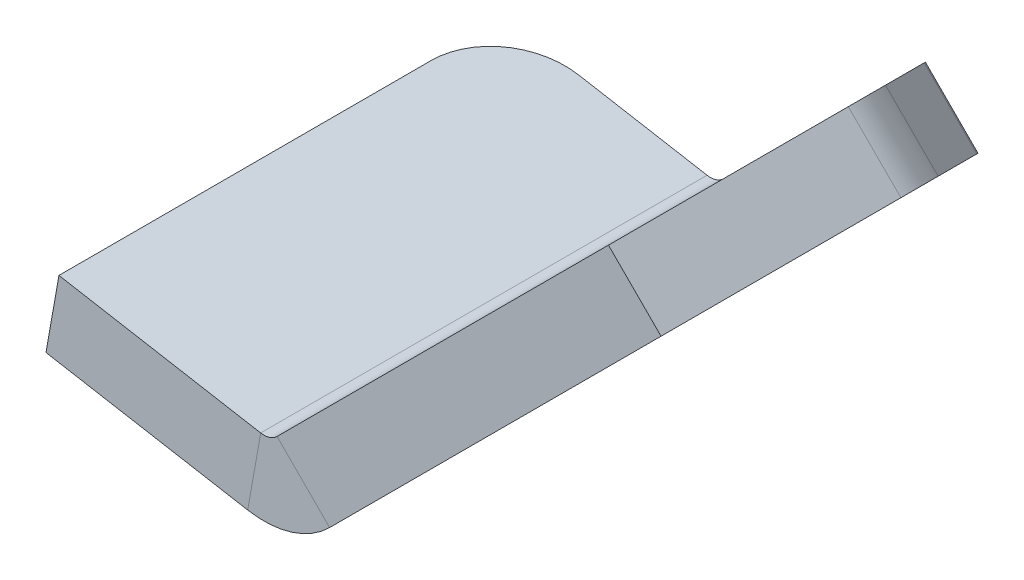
ISO-10303-21;
HEADER;
FILE_DESCRIPTION(('STEP AP214'),'2;1');
FILE_NAME('part.step','',(''),(''),'','','');
FILE_SCHEMA(('AUTOMOTIVE_DESIGN { 1 0 10303 214 1 1 1 1 }'));
ENDSEC;
DATA;
#1=APPLICATION_CONTEXT('core data for automotive mechanical design processes');
#2=APPLICATION_PROTOCOL_DEFINITION('international standard','automotive_design',2000,#1);
#3=PRODUCT_CONTEXT('',#1,'mechanical');
#4=PRODUCT('Part','Part','',(#3));
#5=PRODUCT_RELATED_PRODUCT_CATEGORY('part','',(#4));
#6=PRODUCT_DEFINITION_FORMATION('','',#4);
#7=PRODUCT_DEFINITION_CONTEXT('part definition',#1,'design');
#8=PRODUCT_DEFINITION('design','',#6,#7);
#9=PRODUCT_DEFINITION_SHAPE('','',#8);
#10=(LENGTH_UNIT() NAMED_UNIT(*) SI_UNIT(.MILLI.,.METRE.));
#11=(NAMED_UNIT(*) PLANE_ANGLE_UNIT() SI_UNIT($,.RADIAN.));
#12=(NAMED_UNIT(*) SI_UNIT($,.STERADIAN.) SOLID_ANGLE_UNIT());
#13=UNCERTAINTY_MEASURE_WITH_UNIT(LENGTH_MEASURE(1.E-05),#10,'distance_accuracy_value','');
#14=(GEOMETRIC_REPRESENTATION_CONTEXT(3) GLOBAL_UNCERTAINTY_ASSIGNED_CONTEXT((#13)) GLOBAL_UNIT_ASSIGNED_CONTEXT((#10,
#11,#12)) REPRESENTATION_CONTEXT('',''));
#15=CARTESIAN_POINT('',(0.,0.,0.));
#16=DIRECTION('',(0.,0.,1.));
#17=DIRECTION('',(1.,0.,0.));
#18=AXIS2_PLACEMENT_3D('',#15,#16,#17);
#19=CARTESIAN_POINT('',(-612.230256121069,612.230256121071,-42.8625));
#20=DIRECTION('',(0.,0.,-1.));
#21=DIRECTION('',(-0.707106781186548,-0.707106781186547,0.));
#22=AXIS2_PLACEMENT_3D('',#19,#20,#21);
#23=PLANE('',#22);
#24=DIRECTION('',(-0.707106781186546,0.707106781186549,0.));
#25=VECTOR('',#24,1.);
#26=CARTESIAN_POINT('',(20.8379044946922,1245.29841673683,-42.8625));
#27=LINE('',#26,#25);
#28=CARTESIAN_POINT('',(29.8181606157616,1236.31816061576,-42.8625));
#29=VERTEX_POINT('',#28);
#30=CARTESIAN_POINT('',(20.8379044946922,1245.29841673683,-42.8625));
#31=VERTEX_POINT('',#30);
#32=EDGE_CURVE('E12',#29,#31,#27,.T.);
#33=ORIENTED_EDGE('',*,*,#32,.F.);
#34=DIRECTION('',(-0.707106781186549,-0.707106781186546,0.));
#35=VECTOR('',#34,1.);
#36=CARTESIAN_POINT('',(48.9401280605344,1255.44012806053,-42.8625));
#37=LINE('',#36,#35);
#38=CARTESIAN_POINT('',(20.8379044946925,1227.33790449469,-42.8625));
#39=VERTEX_POINT('',#38);
#40=EDGE_CURVE('E182',#29,#39,#37,.T.);
#41=ORIENTED_EDGE('',*,*,#40,.T.);
#42=DIRECTION('',(-0.707106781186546,0.707106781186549,0.));
#43=VECTOR('',#42,1.);
#44=CARTESIAN_POINT('',(11.857648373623,1236.31816061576,-42.8625));
#45=LINE('',#44,#43);
#46=CARTESIAN_POINT('',(11.857648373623,1236.31816061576,-42.8625));
#47=VERTEX_POINT('',#46);
#48=EDGE_CURVE('E77',#39,#47,#45,.T.);
#49=ORIENTED_EDGE('',*,*,#48,.T.);
#50=DIRECTION('',(-0.707106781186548,-0.707106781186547,0.));
#51=VECTOR('',#50,1.);
#52=CARTESIAN_POINT('',(-612.230256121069,612.230256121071,-42.8625));
#53=LINE('',#52,#51);
#54=EDGE_CURVE('E243',#31,#47,#53,.T.);
#55=ORIENTED_EDGE('',*,*,#54,.F.);
#56=EDGE_LOOP('',(#33,#41,#49,#55));
#57=FACE_BOUND('',#56,.T.);
#58=ADVANCED_FACE('F67',(#57),#23,.T.);
#59=CARTESIAN_POINT('',(11.857648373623,1236.31816061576,-50.8));
#60=DIRECTION('',(-0.707106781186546,0.707106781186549,0.));
#61=DIRECTION('',(-0.707106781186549,-0.707106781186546,0.));
#62=AXIS2_PLACEMENT_3D('',#59,#60,#61);
#63=CYLINDRICAL_SURFACE('',#62,7.93750000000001);
#64=ORIENTED_EDGE('',*,*,#48,.F.);
#65=CARTESIAN_POINT('',(20.8379044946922,1227.33790449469,-50.8));
#66=DIRECTION('',(-0.707106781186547,0.707106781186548,0.));
#67=DIRECTION('',(-0.707106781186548,-0.707106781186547,0.));
#68=AXIS2_PLACEMENT_3D('',#65,#66,#67);
#69=CIRCLE('',#68,7.93750000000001);
#70=CARTESIAN_POINT('',(20.8379044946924,1227.33790449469,-58.7375));
#71=VERTEX_POINT('',#70);
#72=EDGE_CURVE('E199',#71,#39,#69,.T.);
#73=ORIENTED_EDGE('',*,*,#72,.F.);
#74=DIRECTION('',(-0.707106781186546,0.707106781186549,0.));
#75=VECTOR('',#74,1.);
#76=CARTESIAN_POINT('',(11.8576483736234,1236.31816061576,-58.7375));
#77=LINE('',#76,#75);
#78=CARTESIAN_POINT('',(11.8576483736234,1236.31816061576,-58.7375));
#79=VERTEX_POINT('',#78);
#80=EDGE_CURVE('E173',#71,#79,#77,.T.);
#81=ORIENTED_EDGE('',*,*,#80,.T.);
#82=CARTESIAN_POINT('',(11.857648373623,1236.31816061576,-50.8));
#83=DIRECTION('',(-0.707106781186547,0.707106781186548,0.));
#84=DIRECTION('',(-0.707106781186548,-0.707106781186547,0.));
#85=AXIS2_PLACEMENT_3D('',#82,#83,#84);
#86=CIRCLE('',#85,7.93750000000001);
#87=EDGE_CURVE('E253',#79,#47,#86,.T.);
#88=ORIENTED_EDGE('',*,*,#87,.T.);
#89=EDGE_LOOP('',(#64,#73,#81,#88));
#90=FACE_BOUND('',#89,.T.);
#91=ADVANCED_FACE('F256',(#90),#63,.F.);
#92=CARTESIAN_POINT('',(-612.230256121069,612.230256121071,-58.7375));
#93=DIRECTION('',(0.,0.,-1.));
#94=DIRECTION('',(-0.707106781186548,-0.707106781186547,0.));
#95=AXIS2_PLACEMENT_3D('',#92,#93,#94);
#96=PLANE('',#95);
#97=ORIENTED_EDGE('',*,*,#80,.F.);
#98=DIRECTION('',(-0.707106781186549,-0.707106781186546,0.));
#99=VECTOR('',#98,1.);
#100=CARTESIAN_POINT('',(48.9401280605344,1255.44012806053,-58.7375));
#101=LINE('',#100,#99);
#102=CARTESIAN_POINT('',(29.8181606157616,1236.31816061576,-58.7375));
#103=VERTEX_POINT('',#102);
#104=EDGE_CURVE('E180',#103,#71,#101,.T.);
#105=ORIENTED_EDGE('',*,*,#104,.F.);
#106=DIRECTION('',(-0.707106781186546,0.707106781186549,0.));
#107=VECTOR('',#106,1.);
#108=CARTESIAN_POINT('',(20.8379044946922,1245.29841673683,-58.7375));
#109=LINE('',#108,#107);
#110=CARTESIAN_POINT('',(20.8379044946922,1245.29841673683,-58.7375));
#111=VERTEX_POINT('',#110);
#112=EDGE_CURVE('E71',#103,#111,#109,.T.);
#113=ORIENTED_EDGE('',*,*,#112,.T.);
#114=DIRECTION('',(-0.707106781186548,-0.707106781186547,0.));
#115=VECTOR('',#114,1.);
#116=CARTESIAN_POINT('',(-612.230256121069,612.230256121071,-58.7375));
#117=LINE('',#116,#115);
#118=EDGE_CURVE('E315',#111,#79,#117,.T.);
#119=ORIENTED_EDGE('',*,*,#118,.T.);
#120=EDGE_LOOP('',(#97,#105,#113,#119));
#121=FACE_BOUND('',#120,.T.);
#122=ADVANCED_FACE('F185',(#121),#96,.F.);
#123=CARTESIAN_POINT('',(39.9598719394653,1264.4203841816,0.));
#124=DIRECTION('',(0.,0.,-1.));
#125=DIRECTION('',(-0.707106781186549,-0.707106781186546,0.));
#126=AXIS2_PLACEMENT_3D('',#123,#124,#125);
#127=PLANE('',#126);
#128=DIRECTION('',(-0.707106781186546,0.707106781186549,0.));
#129=VECTOR('',#128,1.);
#130=CARTESIAN_POINT('',(-16.6084904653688,1207.85202177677,0.));
#131=LINE('',#130,#129);
#132=CARTESIAN_POINT('',(-7.62823434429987,1198.8717656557,0.));
#133=VERTEX_POINT('',#132);
#134=CARTESIAN_POINT('',(-16.6084904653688,1207.85202177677,0.));
#135=VERTEX_POINT('',#134);
#136=EDGE_CURVE('E174',#133,#135,#131,.T.);
#137=ORIENTED_EDGE('',*,*,#136,.F.);
#138=DIRECTION('',(-0.707106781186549,-0.707106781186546,0.));
#139=VECTOR('',#138,1.);
#140=CARTESIAN_POINT('',(48.9401280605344,1255.44012806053,0.));
#141=LINE('',#140,#139);
#142=CARTESIAN_POINT('',(48.9401280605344,1255.44012806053,0.));
#143=VERTEX_POINT('',#142);
#144=EDGE_CURVE('E344',#143,#133,#141,.T.);
#145=ORIENTED_EDGE('',*,*,#144,.F.);
#146=DIRECTION('',(-0.707106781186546,0.707106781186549,0.));
#147=VECTOR('',#146,1.);
#148=CARTESIAN_POINT('',(39.9598719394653,1264.4203841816,0.));
#149=LINE('',#148,#147);
#150=CARTESIAN_POINT('',(39.9598719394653,1264.4203841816,0.));
#151=VERTEX_POINT('',#150);
#152=EDGE_CURVE('E231',#143,#151,#149,.T.);
#153=ORIENTED_EDGE('',*,*,#152,.T.);
#154=DIRECTION('',(-0.707106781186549,-0.707106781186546,0.));
#155=VECTOR('',#154,1.);
#156=CARTESIAN_POINT('',(39.9598719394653,1264.4203841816,0.));
#157=LINE('',#156,#155);
#158=EDGE_CURVE('E272',#151,#135,#157,.T.);
#159=ORIENTED_EDGE('',*,*,#158,.T.);
#160=EDGE_LOOP('',(#137,#145,#153,#159));
#161=FACE_BOUND('',#160,.T.);
#162=ADVANCED_FACE('F449',(#161),#127,.F.);
#163=CARTESIAN_POINT('',(39.9598719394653,1264.4203841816,-76.2));
#164=DIRECTION('',(-0.707106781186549,-0.707106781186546,0.));
#165=DIRECTION('',(0.,0.,1.));
#166=AXIS2_PLACEMENT_3D('',#163,#164,#165);
#167=PLANE('',#166);
#168=ORIENTED_EDGE('',*,*,#152,.F.);
#169=DIRECTION('',(0.,0.,1.));
#170=VECTOR('',#169,1.);
#171=CARTESIAN_POINT('',(48.9401280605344,1255.44012806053,-76.2));
#172=LINE('',#171,#170);
#173=CARTESIAN_POINT('',(48.9401280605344,1255.44012806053,-40.9475823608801));
#174=VERTEX_POINT('',#173);
#175=EDGE_CURVE('E355',#174,#143,#172,.T.);
#176=ORIENTED_EDGE('',*,*,#175,.F.);
#177=DIRECTION('',(-0.707106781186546,0.707106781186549,0.));
#178=VECTOR('',#177,1.);
#179=CARTESIAN_POINT('',(39.9598719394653,1264.4203841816,-40.9475823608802));
#180=LINE('',#179,#178);
#181=CARTESIAN_POINT('',(39.9598719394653,1264.4203841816,-40.9475823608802));
#182=VERTEX_POINT('',#181);
#183=EDGE_CURVE('E228',#174,#182,#180,.T.);
#184=ORIENTED_EDGE('',*,*,#183,.T.);
#185=DIRECTION('',(0.,0.,1.));
#186=VECTOR('',#185,1.);
#187=CARTESIAN_POINT('',(39.9598719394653,1264.4203841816,-76.2));
#188=LINE('',#187,#186);
#189=EDGE_CURVE('E276',#182,#151,#188,.T.);
#190=ORIENTED_EDGE('',*,*,#189,.T.);
#191=EDGE_LOOP('',(#168,#176,#184,#190));
#192=FACE_BOUND('',#191,.T.);
#193=ADVANCED_FACE('F448',(#192),#167,.F.);
#194=CARTESIAN_POINT('',(30.9796158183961,1255.44012806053,-40.9475823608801));
#195=DIRECTION('',(-0.707106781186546,0.707106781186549,0.));
#196=DIRECTION('',(-0.707106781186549,-0.707106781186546,0.));
#197=AXIS2_PLACEMENT_3D('',#194,#195,#196);
#198=CYLINDRICAL_SURFACE('',#197,12.7);
#199=ORIENTED_EDGE('',*,*,#183,.F.);
#200=CARTESIAN_POINT('',(39.9598719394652,1246.45987193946,-40.9475823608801));
#201=DIRECTION('',(-0.707106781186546,0.707106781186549,0.));
#202=DIRECTION('',(-0.707106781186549,-0.707106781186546,0.));
#203=AXIS2_PLACEMENT_3D('',#200,#201,#202);
#204=CIRCLE('',#203,12.7);
#205=CARTESIAN_POINT('',(46.3098719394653,1252.80987193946,-49.9278384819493));
#206=VERTEX_POINT('',#205);
#207=EDGE_CURVE('E338',#174,#206,#204,.T.);
#208=ORIENTED_EDGE('',*,*,#207,.T.);
#209=DIRECTION('',(-0.707106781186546,0.707106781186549,0.));
#210=VECTOR('',#209,1.);
#211=CARTESIAN_POINT('',(37.3296158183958,1261.79012806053,-49.9278384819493));
#212=LINE('',#211,#210);
#213=CARTESIAN_POINT('',(37.3296158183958,1261.79012806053,-49.9278384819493));
#214=VERTEX_POINT('',#213);
#215=EDGE_CURVE('E225',#206,#214,#212,.T.);
#216=ORIENTED_EDGE('',*,*,#215,.T.);
#217=CARTESIAN_POINT('',(30.9796158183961,1255.44012806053,-40.9475823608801));
#218=DIRECTION('',(-0.707106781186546,0.707106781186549,0.));
#219=DIRECTION('',(-0.707106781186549,-0.707106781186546,0.));
#220=AXIS2_PLACEMENT_3D('',#217,#218,#219);
#221=CIRCLE('',#220,12.7);
#222=EDGE_CURVE('E280',#182,#214,#221,.T.);
#223=ORIENTED_EDGE('',*,*,#222,.F.);
#224=EDGE_LOOP('',(#199,#208,#216,#223));
#225=FACE_BOUND('',#224,.T.);
#226=ADVANCED_FACE('F410',(#225),#198,.T.);
#227=CARTESIAN_POINT('',(39.9598719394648,1264.4203841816,-46.2080946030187));
#228=DIRECTION('',(0.500000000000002,0.5,-0.707106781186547));
#229=DIRECTION('',(-0.499999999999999,-0.499999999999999,-0.707106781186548));
#230=AXIS2_PLACEMENT_3D('',#227,#228,#229);
#231=PLANE('',#230);
#232=ORIENTED_EDGE('',*,*,#215,.F.);
#233=DIRECTION('',(-0.499999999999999,-0.499999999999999,-0.707106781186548));
#234=VECTOR('',#233,1.);
#235=CARTESIAN_POINT('',(48.940128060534,1255.44012806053,-46.2080946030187));
#236=LINE('',#235,#234);
#237=CARTESIAN_POINT('',(30.3629044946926,1236.86290449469,-72.4802561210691));
#238=VERTEX_POINT('',#237);
#239=EDGE_CURVE('E202',#206,#238,#236,.T.);
#240=ORIENTED_EDGE('',*,*,#239,.T.);
#241=DIRECTION('',(-0.707106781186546,0.707106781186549,0.));
#242=VECTOR('',#241,1.);
#243=CARTESIAN_POINT('',(21.3826483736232,1245.84316061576,-72.4802561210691));
#244=LINE('',#243,#242);
#245=CARTESIAN_POINT('',(21.3826483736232,1245.84316061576,-72.4802561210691));
#246=VERTEX_POINT('',#245);
#247=EDGE_CURVE('E222',#238,#246,#244,.T.);
#248=ORIENTED_EDGE('',*,*,#247,.T.);
#249=DIRECTION('',(-0.499999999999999,-0.499999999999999,-0.707106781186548));
#250=VECTOR('',#249,1.);
#251=CARTESIAN_POINT('',(39.9598719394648,1264.4203841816,-46.2080946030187));
#252=LINE('',#251,#250);
#253=EDGE_CURVE('E257',#214,#246,#252,.T.);
#254=ORIENTED_EDGE('',*,*,#253,.F.);
#255=EDGE_LOOP('',(#232,#240,#248,#254));
#256=FACE_BOUND('',#255,.T.);
#257=ADVANCED_FACE('F398',(#256),#231,.T.);
#258=CARTESIAN_POINT('',(15.0326483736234,1239.49316061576,-63.5));
#259=DIRECTION('',(-0.707106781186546,0.707106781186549,0.));
#260=DIRECTION('',(-0.707106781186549,-0.707106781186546,0.));
#261=AXIS2_PLACEMENT_3D('',#258,#259,#260);
#262=CYLINDRICAL_SURFACE('',#261,12.7);
#263=ORIENTED_EDGE('',*,*,#247,.F.);
#264=CARTESIAN_POINT('',(24.0129044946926,1230.51290449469,-63.5));
#265=DIRECTION('',(-0.707106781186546,0.707106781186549,0.));
#266=DIRECTION('',(-0.707106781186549,-0.707106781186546,0.));
#267=AXIS2_PLACEMENT_3D('',#264,#265,#266);
#268=CIRCLE('',#267,12.7);
#269=CARTESIAN_POINT('',(24.0129044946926,1230.51290449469,-76.2));
#270=VERTEX_POINT('',#269);
#271=EDGE_CURVE('E345',#238,#270,#268,.T.);
#272=ORIENTED_EDGE('',*,*,#271,.T.);
#273=DIRECTION('',(-0.707106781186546,0.707106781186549,0.));
#274=VECTOR('',#273,1.);
#275=CARTESIAN_POINT('',(15.0326483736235,1239.49316061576,-76.2));
#276=LINE('',#275,#274);
#277=CARTESIAN_POINT('',(15.0326483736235,1239.49316061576,-76.2));
#278=VERTEX_POINT('',#277);
#279=EDGE_CURVE('E219',#270,#278,#276,.T.);
#280=ORIENTED_EDGE('',*,*,#279,.T.);
#281=CARTESIAN_POINT('',(15.0326483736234,1239.49316061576,-63.5));
#282=DIRECTION('',(-0.707106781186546,0.707106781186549,0.));
#283=DIRECTION('',(-0.707106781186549,-0.707106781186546,0.));
#284=AXIS2_PLACEMENT_3D('',#281,#282,#283);
#285=CIRCLE('',#284,12.7);
#286=EDGE_CURVE('E261',#246,#278,#285,.T.);
#287=ORIENTED_EDGE('',*,*,#286,.F.);
#288=EDGE_LOOP('',(#263,#272,#280,#287));
#289=FACE_BOUND('',#288,.T.);
#290=ADVANCED_FACE('F392',(#289),#262,.T.);
#291=CARTESIAN_POINT('',(39.9598719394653,1264.4203841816,-76.2));
#292=DIRECTION('',(0.,0.,-1.));
#293=DIRECTION('',(-0.707106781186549,-0.707106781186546,0.));
#294=AXIS2_PLACEMENT_3D('',#291,#292,#293);
#295=PLANE('',#294);
#296=ORIENTED_EDGE('',*,*,#279,.F.);
#297=DIRECTION('',(-0.707106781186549,-0.707106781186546,0.));
#298=VECTOR('',#297,1.);
#299=CARTESIAN_POINT('',(48.9401280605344,1255.44012806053,-76.2));
#300=LINE('',#299,#298);
#301=CARTESIAN_POINT('',(-7.62823434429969,1198.8717656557,-76.2));
#302=VERTEX_POINT('',#301);
#303=EDGE_CURVE('E340',#270,#302,#300,.T.);
#304=ORIENTED_EDGE('',*,*,#303,.T.);
#305=DIRECTION('',(-0.707106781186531,0.707106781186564,0.));
#306=VECTOR('',#305,1.);
#307=CARTESIAN_POINT('',(-16.6084904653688,1207.85202177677,-76.2));
#308=LINE('',#307,#306);
#309=CARTESIAN_POINT('',(-16.6084904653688,1207.85202177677,-76.2));
#310=VERTEX_POINT('',#309);
#311=EDGE_CURVE('E216',#302,#310,#308,.T.);
#312=ORIENTED_EDGE('',*,*,#311,.T.);
#313=DIRECTION('',(-0.707106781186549,-0.707106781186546,0.));
#314=VECTOR('',#313,1.);
#315=CARTESIAN_POINT('',(39.9598719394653,1264.4203841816,-76.2));
#316=LINE('',#315,#314);
#317=EDGE_CURVE('E268',#278,#310,#316,.T.);
#318=ORIENTED_EDGE('',*,*,#317,.F.);
#319=EDGE_LOOP('',(#296,#304,#312,#318));
#320=FACE_BOUND('',#319,.T.);
#321=ADVANCED_FACE('F386',(#320),#295,.T.);
#322=CARTESIAN_POINT('',(-18.8535544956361,1210.09708580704,-76.2));
#323=DIRECTION('',(0.,0.,-1.));
#324=DIRECTION('',(-1.,0.,0.));
#325=AXIS2_PLACEMENT_3D('',#322,#323,#324);
#326=PLANE('',#325);
#327=ORIENTED_EDGE('',*,*,#311,.F.);
#328=CARTESIAN_POINT('',(-18.8535544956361,1210.09708580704,-76.2));
#329=DIRECTION('',(0.,0.,-1.));
#330=DIRECTION('',(-1.,0.,0.));
#331=AXIS2_PLACEMENT_3D('',#328,#329,#330);
#332=CIRCLE('',#331,15.875);
#333=CARTESIAN_POINT('',(-21.6102193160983,1194.46326272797,-76.2));
#334=VERTEX_POINT('',#333);
#335=EDGE_CURVE('E188',#302,#334,#332,.T.);
#336=ORIENTED_EDGE('',*,*,#335,.T.);
#337=DIRECTION('',(0.173648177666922,0.98480775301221,0.));
#338=VECTOR('',#337,1.);
#339=CARTESIAN_POINT('',(-19.4048874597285,1206.97032119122,-76.2));
#340=LINE('',#339,#338);
#341=CARTESIAN_POINT('',(-19.4048874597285,1206.97032119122,-76.2));
#342=VERTEX_POINT('',#341);
#343=EDGE_CURVE('E214',#334,#342,#340,.T.);
#344=ORIENTED_EDGE('',*,*,#343,.T.);
#345=CARTESIAN_POINT('',(-18.8535544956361,1210.09708580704,-76.2));
#346=DIRECTION('',(0.,0.,1.));
#347=DIRECTION('',(1.,0.,0.));
#348=AXIS2_PLACEMENT_3D('',#345,#346,#347);
#349=CIRCLE('',#348,3.175);
#350=EDGE_CURVE('E310',#310,#342,#349,.F.);
#351=ORIENTED_EDGE('',*,*,#350,.F.);
#352=EDGE_LOOP('',(#327,#336,#344,#351));
#353=FACE_BOUND('',#352,.T.);
#354=ADVANCED_FACE('F383',(#353),#326,.T.);
#355=CARTESIAN_POINT('',(-17.7771968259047,1206.68331541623,-76.2));
#356=DIRECTION('',(0.,0.,-1.));
#357=DIRECTION('',(-0.98480775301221,0.173648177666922,0.));
#358=AXIS2_PLACEMENT_3D('',#355,#356,#357);
#359=PLANE('',#358);
#360=ORIENTED_EDGE('',*,*,#343,.F.);
#361=DIRECTION('',(-0.98480775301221,0.173648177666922,0.));
#362=VECTOR('',#361,1.);
#363=CARTESIAN_POINT('',(-19.9825286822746,1194.17625695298,-76.2));
#364=LINE('',#363,#362);
#365=CARTESIAN_POINT('',(-43.5402756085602,1198.33012334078,-76.2));
#366=VERTEX_POINT('',#365);
#367=EDGE_CURVE('E335',#334,#366,#364,.T.);
#368=ORIENTED_EDGE('',*,*,#367,.T.);
#369=DIRECTION('',(0.173648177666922,0.98480775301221,0.));
#370=VECTOR('',#369,1.);
#371=CARTESIAN_POINT('',(-41.3349437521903,1210.83718180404,-76.2));
#372=LINE('',#371,#370);
#373=CARTESIAN_POINT('',(-41.3349437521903,1210.83718180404,-76.2));
#374=VERTEX_POINT('',#373);
#375=EDGE_CURVE('E211',#366,#374,#372,.T.);
#376=ORIENTED_EDGE('',*,*,#375,.T.);
#377=DIRECTION('',(-0.98480775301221,0.173648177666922,0.));
#378=VECTOR('',#377,1.);
#379=CARTESIAN_POINT('',(-17.7771968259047,1206.68331541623,-76.2));
#380=LINE('',#379,#378);
#381=EDGE_CURVE('E284',#342,#374,#380,.T.);
#382=ORIENTED_EDGE('',*,*,#381,.F.);
#383=EDGE_LOOP('',(#360,#368,#376,#382));
#384=FACE_BOUND('',#383,.T.);
#385=ADVANCED_FACE('F444',(#384),#359,.T.);
#386=CARTESIAN_POINT('',(-41.3349437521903,1210.83718180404,-63.5));
#387=DIRECTION('',(0.173648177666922,0.98480775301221,0.));
#388=DIRECTION('',(-0.98480775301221,0.173648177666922,0.));
#389=AXIS2_PLACEMENT_3D('',#386,#387,#388);
#390=CYLINDRICAL_SURFACE('',#389,12.7);
#391=ORIENTED_EDGE('',*,*,#375,.F.);
#392=CARTESIAN_POINT('',(-43.5402756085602,1198.33012334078,-63.5));
#393=DIRECTION('',(0.173648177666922,0.98480775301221,0.));
#394=DIRECTION('',(-0.98480775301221,0.173648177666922,0.));
#395=AXIS2_PLACEMENT_3D('',#392,#393,#394);
#396=CIRCLE('',#395,12.7);
#397=CARTESIAN_POINT('',(-56.0473340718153,1200.53545519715,-63.5));
#398=VERTEX_POINT('',#397);
#399=EDGE_CURVE('E331',#366,#398,#396,.T.);
#400=ORIENTED_EDGE('',*,*,#399,.T.);
#401=DIRECTION('',(0.173648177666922,0.98480775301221,0.));
#402=VECTOR('',#401,1.);
#403=CARTESIAN_POINT('',(-53.8420022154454,1213.04251366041,-63.5));
#404=LINE('',#403,#402);
#405=CARTESIAN_POINT('',(-53.8420022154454,1213.04251366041,-63.5));
#406=VERTEX_POINT('',#405);
#407=EDGE_CURVE('E208',#398,#406,#404,.T.);
#408=ORIENTED_EDGE('',*,*,#407,.T.);
#409=CARTESIAN_POINT('',(-41.3349437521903,1210.83718180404,-63.5));
#410=DIRECTION('',(0.173648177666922,0.98480775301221,0.));
#411=DIRECTION('',(-0.98480775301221,0.173648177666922,0.));
#412=AXIS2_PLACEMENT_3D('',#409,#410,#411);
#413=CIRCLE('',#412,12.7);
#414=EDGE_CURVE('E288',#374,#406,#413,.T.);
#415=ORIENTED_EDGE('',*,*,#414,.F.);
#416=EDGE_LOOP('',(#391,#400,#408,#415));
#417=FACE_BOUND('',#416,.T.);
#418=ADVANCED_FACE('F443',(#417),#390,.T.);
#419=CARTESIAN_POINT('',(-53.8420022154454,1213.04251366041,-76.2));
#420=DIRECTION('',(-0.98480775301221,0.173648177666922,0.));
#421=DIRECTION('',(0.,0.,1.));
#422=AXIS2_PLACEMENT_3D('',#419,#420,#421);
#423=PLANE('',#422);
#424=ORIENTED_EDGE('',*,*,#407,.F.);
#425=DIRECTION('',(0.,0.,1.));
#426=VECTOR('',#425,1.);
#427=CARTESIAN_POINT('',(-56.0473340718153,1200.53545519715,-76.2));
#428=LINE('',#427,#426);
#429=CARTESIAN_POINT('',(-56.0473340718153,1200.53545519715,0.));
#430=VERTEX_POINT('',#429);
#431=EDGE_CURVE('E327',#398,#430,#428,.T.);
#432=ORIENTED_EDGE('',*,*,#431,.T.);
#433=DIRECTION('',(0.173648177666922,0.98480775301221,0.));
#434=VECTOR('',#433,1.);
#435=CARTESIAN_POINT('',(-53.8420022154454,1213.04251366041,0.));
#436=LINE('',#435,#434);
#437=CARTESIAN_POINT('',(-53.8420022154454,1213.04251366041,0.));
#438=VERTEX_POINT('',#437);
#439=EDGE_CURVE('E205',#430,#438,#436,.T.);
#440=ORIENTED_EDGE('',*,*,#439,.T.);
#441=DIRECTION('',(0.,0.,1.));
#442=VECTOR('',#441,1.);
#443=CARTESIAN_POINT('',(-53.8420022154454,1213.04251366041,-76.2));
#444=LINE('',#443,#442);
#445=EDGE_CURVE('E292',#406,#438,#444,.T.);
#446=ORIENTED_EDGE('',*,*,#445,.F.);
#447=EDGE_LOOP('',(#424,#432,#440,#446));
#448=FACE_BOUND('',#447,.T.);
#449=ADVANCED_FACE('F435',(#448),#423,.T.);
#450=CARTESIAN_POINT('',(-17.7771968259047,1206.68331541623,0.));
#451=DIRECTION('',(0.,0.,-1.));
#452=DIRECTION('',(-0.98480775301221,0.173648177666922,0.));
#453=AXIS2_PLACEMENT_3D('',#450,#451,#452);
#454=PLANE('',#453);
#455=ORIENTED_EDGE('',*,*,#439,.F.);
#456=DIRECTION('',(-0.98480775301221,0.173648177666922,0.));
#457=VECTOR('',#456,1.);
#458=CARTESIAN_POINT('',(-19.9825286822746,1194.17625695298,0.));
#459=LINE('',#458,#457);
#460=CARTESIAN_POINT('',(-21.6102193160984,1194.46326272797,0.));
#461=VERTEX_POINT('',#460);
#462=EDGE_CURVE('E323',#461,#430,#459,.T.);
#463=ORIENTED_EDGE('',*,*,#462,.F.);
#464=DIRECTION('',(0.173648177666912,0.984807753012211,0.));
#465=VECTOR('',#464,1.);
#466=CARTESIAN_POINT('',(-19.4048874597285,1206.97032119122,0.));
#467=LINE('',#466,#465);
#468=CARTESIAN_POINT('',(-19.4048874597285,1206.97032119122,0.));
#469=VERTEX_POINT('',#468);
#470=EDGE_CURVE('E87',#461,#469,#467,.T.);
#471=ORIENTED_EDGE('',*,*,#470,.T.);
#472=DIRECTION('',(-0.98480775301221,0.173648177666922,0.));
#473=VECTOR('',#472,1.);
#474=CARTESIAN_POINT('',(-17.7771968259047,1206.68331541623,0.));
#475=LINE('',#474,#473);
#476=EDGE_CURVE('E296',#469,#438,#475,.T.);
#477=ORIENTED_EDGE('',*,*,#476,.T.);
#478=EDGE_LOOP('',(#455,#463,#471,#477));
#479=FACE_BOUND('',#478,.T.);
#480=ADVANCED_FACE('F376',(#479),#454,.F.);
#481=CARTESIAN_POINT('',(20.8379044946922,1245.29841673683,-50.8));
#482=DIRECTION('',(-0.707106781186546,0.707106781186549,0.));
#483=DIRECTION('',(-0.707106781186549,-0.707106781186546,0.));
#484=AXIS2_PLACEMENT_3D('',#481,#482,#483);
#485=CYLINDRICAL_SURFACE('',#484,7.93750000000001);
#486=CARTESIAN_POINT('',(29.8181606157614,1236.31816061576,-50.8));
#487=DIRECTION('',(-0.707106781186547,0.707106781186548,0.));
#488=DIRECTION('',(-0.707106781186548,-0.707106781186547,0.));
#489=AXIS2_PLACEMENT_3D('',#486,#487,#488);
#490=CIRCLE('',#489,7.93750000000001);
#491=EDGE_CURVE('E166',#29,#103,#490,.T.);
#492=ORIENTED_EDGE('',*,*,#491,.F.);
#493=ORIENTED_EDGE('',*,*,#32,.T.);
#494=CARTESIAN_POINT('',(20.8379044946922,1245.29841673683,-50.8));
#495=DIRECTION('',(-0.707106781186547,0.707106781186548,0.));
#496=DIRECTION('',(-0.707106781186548,-0.707106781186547,0.));
#497=AXIS2_PLACEMENT_3D('',#494,#495,#496);
#498=CIRCLE('',#497,7.93750000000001);
#499=EDGE_CURVE('E168',#31,#111,#498,.T.);
#500=ORIENTED_EDGE('',*,*,#499,.T.);
#501=ORIENTED_EDGE('',*,*,#112,.F.);
#502=EDGE_LOOP('',(#492,#493,#500,#501));
#503=FACE_BOUND('',#502,.T.);
#504=ADVANCED_FACE('F69',(#503),#485,.F.);
#505=CARTESIAN_POINT('',(-18.8535544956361,1210.09708580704,0.));
#506=DIRECTION('',(0.,0.,1.));
#507=DIRECTION('',(1.,0.,0.));
#508=AXIS2_PLACEMENT_3D('',#505,#506,#507);
#509=PLANE('',#508);
#510=CARTESIAN_POINT('',(-18.8535544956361,1210.09708580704,0.));
#511=DIRECTION('',(0.,0.,-1.));
#512=DIRECTION('',(-1.,0.,0.));
#513=AXIS2_PLACEMENT_3D('',#510,#511,#512);
#514=CIRCLE('',#513,15.875);
#515=EDGE_CURVE('E194',#461,#133,#514,.F.);
#516=ORIENTED_EDGE('',*,*,#515,.T.);
#517=ORIENTED_EDGE('',*,*,#136,.T.);
#518=CARTESIAN_POINT('',(-18.8535544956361,1210.09708580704,0.));
#519=DIRECTION('',(0.,0.,-1.));
#520=DIRECTION('',(-1.,0.,0.));
#521=AXIS2_PLACEMENT_3D('',#518,#519,#520);
#522=CIRCLE('',#521,3.175);
#523=EDGE_CURVE('E306',#469,#135,#522,.F.);
#524=ORIENTED_EDGE('',*,*,#523,.F.);
#525=ORIENTED_EDGE('',*,*,#470,.F.);
#526=EDGE_LOOP('',(#516,#517,#524,#525));
#527=FACE_BOUND('',#526,.T.);
#528=ADVANCED_FACE('F370',(#527),#509,.T.);
#529=CARTESIAN_POINT('',(-17.7771968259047,1206.68331541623,-76.2));
#530=DIRECTION('',(0.173648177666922,0.98480775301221,0.));
#531=DIRECTION('',(-0.98480775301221,0.173648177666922,0.));
#532=AXIS2_PLACEMENT_3D('',#529,#530,#531);
#533=PLANE('',#532);
#534=ORIENTED_EDGE('',*,*,#476,.F.);
#535=DIRECTION('',(0.,0.,1.));
#536=VECTOR('',#535,1.);
#537=CARTESIAN_POINT('',(-19.4048874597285,1206.97032119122,-76.2));
#538=LINE('',#537,#536);
#539=EDGE_CURVE('E237',#469,#342,#538,.F.);
#540=ORIENTED_EDGE('',*,*,#539,.T.);
#541=ORIENTED_EDGE('',*,*,#381,.T.);
#542=ORIENTED_EDGE('',*,*,#414,.T.);
#543=ORIENTED_EDGE('',*,*,#445,.T.);
#544=EDGE_LOOP('',(#534,#540,#541,#542,#543));
#545=FACE_BOUND('',#544,.T.);
#546=ADVANCED_FACE('F438',(#545),#533,.T.);
#547=CARTESIAN_POINT('',(39.9598719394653,1264.4203841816,-76.2));
#548=DIRECTION('',(-0.707106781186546,0.707106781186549,0.));
#549=DIRECTION('',(-0.707106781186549,-0.707106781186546,0.));
#550=AXIS2_PLACEMENT_3D('',#547,#548,#549);
#551=PLANE('',#550);
#552=ORIENTED_EDGE('',*,*,#118,.F.);
#553=ORIENTED_EDGE('',*,*,#499,.F.);
#554=ORIENTED_EDGE('',*,*,#54,.T.);
#555=ORIENTED_EDGE('',*,*,#87,.F.);
#556=EDGE_LOOP('',(#552,#553,#554,#555));
#557=FACE_BOUND('',#556,.T.);
#558=ORIENTED_EDGE('',*,*,#317,.T.);
#559=DIRECTION('',(0.,0.,1.));
#560=VECTOR('',#559,1.);
#561=CARTESIAN_POINT('',(-16.6084904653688,1207.85202177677,0.));
#562=LINE('',#561,#560);
#563=EDGE_CURVE('E299',#310,#135,#562,.T.);
#564=ORIENTED_EDGE('',*,*,#563,.T.);
#565=ORIENTED_EDGE('',*,*,#158,.F.);
#566=ORIENTED_EDGE('',*,*,#189,.F.);
#567=ORIENTED_EDGE('',*,*,#222,.T.);
#568=ORIENTED_EDGE('',*,*,#253,.T.);
#569=ORIENTED_EDGE('',*,*,#286,.T.);
#570=EDGE_LOOP('',(#558,#564,#565,#566,#567,#568,#569));
#571=FACE_BOUND('',#570,.T.);
#572=ADVANCED_FACE('F251',(#557,#571),#551,.T.);
#573=CARTESIAN_POINT('',(-18.8535544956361,1210.09708580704,-76.2));
#574=DIRECTION('',(0.,0.,-1.));
#575=DIRECTION('',(-1.,0.,0.));
#576=AXIS2_PLACEMENT_3D('',#573,#574,#575);
#577=CYLINDRICAL_SURFACE('',#576,3.175);
#578=ORIENTED_EDGE('',*,*,#350,.T.);
#579=ORIENTED_EDGE('',*,*,#539,.F.);
#580=ORIENTED_EDGE('',*,*,#523,.T.);
#581=ORIENTED_EDGE('',*,*,#563,.F.);
#582=EDGE_LOOP('',(#578,#579,#580,#581));
#583=FACE_BOUND('',#582,.T.);
#584=ADVANCED_FACE('F446',(#583),#577,.F.);
#585=CARTESIAN_POINT('',(-19.9825286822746,1194.17625695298,-76.2));
#586=DIRECTION('',(0.173648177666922,0.98480775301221,0.));
#587=DIRECTION('',(-0.98480775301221,0.173648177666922,0.));
#588=AXIS2_PLACEMENT_3D('',#585,#586,#587);
#589=PLANE('',#588);
#590=ORIENTED_EDGE('',*,*,#462,.T.);
#591=ORIENTED_EDGE('',*,*,#431,.F.);
#592=ORIENTED_EDGE('',*,*,#399,.F.);
#593=ORIENTED_EDGE('',*,*,#367,.F.);
#594=DIRECTION('',(0.,0.,1.));
#595=VECTOR('',#594,1.);
#596=CARTESIAN_POINT('',(-21.6102193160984,1194.46326272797,-76.2));
#597=LINE('',#596,#595);
#598=EDGE_CURVE('E311',#461,#334,#597,.F.);
#599=ORIENTED_EDGE('',*,*,#598,.F.);
#600=EDGE_LOOP('',(#590,#591,#592,#593,#599));
#601=FACE_BOUND('',#600,.T.);
#602=ADVANCED_FACE('F379',(#601),#589,.F.);
#603=CARTESIAN_POINT('',(48.9401280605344,1255.44012806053,-76.2));
#604=DIRECTION('',(-0.707106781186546,0.707106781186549,0.));
#605=DIRECTION('',(-0.707106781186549,-0.707106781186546,0.));
#606=AXIS2_PLACEMENT_3D('',#603,#604,#605);
#607=PLANE('',#606);
#608=ORIENTED_EDGE('',*,*,#104,.T.);
#609=ORIENTED_EDGE('',*,*,#72,.T.);
#610=ORIENTED_EDGE('',*,*,#40,.F.);
#611=ORIENTED_EDGE('',*,*,#491,.T.);
#612=EDGE_LOOP('',(#608,#609,#610,#611));
#613=FACE_BOUND('',#612,.T.);
#614=ORIENTED_EDGE('',*,*,#303,.F.);
#615=ORIENTED_EDGE('',*,*,#271,.F.);
#616=ORIENTED_EDGE('',*,*,#239,.F.);
#617=ORIENTED_EDGE('',*,*,#207,.F.);
#618=ORIENTED_EDGE('',*,*,#175,.T.);
#619=ORIENTED_EDGE('',*,*,#144,.T.);
#620=DIRECTION('',(0.,0.,1.));
#621=VECTOR('',#620,1.);
#622=CARTESIAN_POINT('',(-7.62823434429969,1198.8717656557,-76.2));
#623=LINE('',#622,#621);
#624=EDGE_CURVE('E319',#302,#133,#623,.T.);
#625=ORIENTED_EDGE('',*,*,#624,.F.);
#626=EDGE_LOOP('',(#614,#615,#616,#617,#618,#619,#625));
#627=FACE_BOUND('',#626,.T.);
#628=ADVANCED_FACE('F177',(#613,#627),#607,.F.);
#629=CARTESIAN_POINT('',(-18.8535544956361,1210.09708580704,-76.2));
#630=DIRECTION('',(0.,0.,-1.));
#631=DIRECTION('',(-1.,0.,0.));
#632=AXIS2_PLACEMENT_3D('',#629,#630,#631);
#633=CYLINDRICAL_SURFACE('',#632,15.875);
#634=ORIENTED_EDGE('',*,*,#335,.F.);
#635=ORIENTED_EDGE('',*,*,#624,.T.);
#636=ORIENTED_EDGE('',*,*,#515,.F.);
#637=ORIENTED_EDGE('',*,*,#598,.T.);
#638=EDGE_LOOP('',(#634,#635,#636,#637));
#639=FACE_BOUND('',#638,.T.);
#640=ADVANCED_FACE('F374',(#639),#633,.T.);
#641=CLOSED_SHELL('',(#58,#91,#122,#162,#193,#226,#257,#290,#321,#354,#385,#418,#449,#480,#504,
#528,#546,#572,#584,#602,#628,#640));
#642=MANIFOLD_SOLID_BREP('B2',#641);
#643=ADVANCED_BREP_SHAPE_REPRESENTATION('',(#18,#642),#14);
#644=SHAPE_DEFINITION_REPRESENTATION(#9,#643);
ENDSEC;
END-ISO-10303-21;
